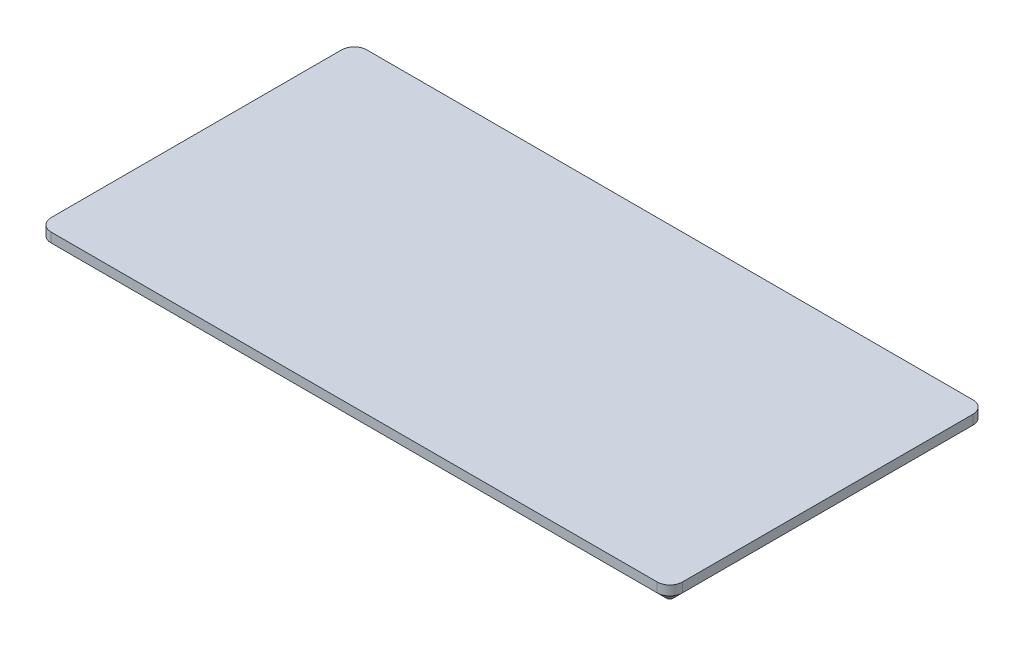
ISO-10303-21;
HEADER;
FILE_DESCRIPTION(('STEP AP214'),'2;1');
FILE_NAME('part.step','',(''),(''),'','','');
FILE_SCHEMA(('AUTOMOTIVE_DESIGN { 1 0 10303 214 1 1 1 1 }'));
ENDSEC;
DATA;
#1=APPLICATION_CONTEXT('core data for automotive mechanical design processes');
#2=APPLICATION_PROTOCOL_DEFINITION('international standard','automotive_design',2000,#1);
#3=PRODUCT_CONTEXT('',#1,'mechanical');
#4=PRODUCT('Part','Part','',(#3));
#5=PRODUCT_RELATED_PRODUCT_CATEGORY('part','',(#4));
#6=PRODUCT_DEFINITION_FORMATION('','',#4);
#7=PRODUCT_DEFINITION_CONTEXT('part definition',#1,'design');
#8=PRODUCT_DEFINITION('design','',#6,#7);
#9=PRODUCT_DEFINITION_SHAPE('','',#8);
#10=(LENGTH_UNIT() NAMED_UNIT(*) SI_UNIT(.MILLI.,.METRE.));
#11=(NAMED_UNIT(*) PLANE_ANGLE_UNIT() SI_UNIT($,.RADIAN.));
#12=(NAMED_UNIT(*) SI_UNIT($,.STERADIAN.) SOLID_ANGLE_UNIT());
#13=UNCERTAINTY_MEASURE_WITH_UNIT(LENGTH_MEASURE(1.E-05),#10,'distance_accuracy_value','');
#14=(GEOMETRIC_REPRESENTATION_CONTEXT(3) GLOBAL_UNCERTAINTY_ASSIGNED_CONTEXT((#13)) GLOBAL_UNIT_ASSIGNED_CONTEXT((#10,
#11,#12)) REPRESENTATION_CONTEXT('',''));
#15=CARTESIAN_POINT('',(0.,0.,0.));
#16=DIRECTION('',(0.,0.,1.));
#17=DIRECTION('',(1.,0.,0.));
#18=AXIS2_PLACEMENT_3D('',#15,#16,#17);
#19=CARTESIAN_POINT('',(500.,30.,-250.));
#20=DIRECTION('',(-1.,0.,0.));
#21=DIRECTION('',(0.,0.,1.));
#22=AXIS2_PLACEMENT_3D('',#19,#20,#21);
#23=PLANE('',#22);
#24=DIRECTION('',(0.,-1.,0.));
#25=VECTOR('',#24,1.);
#26=CARTESIAN_POINT('',(500.,30.,230.));
#27=LINE('',#26,#25);
#28=CARTESIAN_POINT('',(500.,30.,230.));
#29=VERTEX_POINT('',#28);
#30=CARTESIAN_POINT('',(500.,15.,230.));
#31=VERTEX_POINT('',#30);
#32=EDGE_CURVE('E147',#29,#31,#27,.T.);
#33=ORIENTED_EDGE('',*,*,#32,.T.);
#34=DIRECTION('',(0.,0.,-1.));
#35=VECTOR('',#34,1.);
#36=CARTESIAN_POINT('',(500.,15.,-250.));
#37=LINE('',#36,#35);
#38=CARTESIAN_POINT('',(500.,15.,-230.));
#39=VERTEX_POINT('',#38);
#40=EDGE_CURVE('E178',#31,#39,#37,.T.);
#41=ORIENTED_EDGE('',*,*,#40,.T.);
#42=DIRECTION('',(0.,-1.,0.));
#43=VECTOR('',#42,1.);
#44=CARTESIAN_POINT('',(500.,30.,-230.));
#45=LINE('',#44,#43);
#46=CARTESIAN_POINT('',(500.,30.,-230.));
#47=VERTEX_POINT('',#46);
#48=EDGE_CURVE('E150',#39,#47,#45,.F.);
#49=ORIENTED_EDGE('',*,*,#48,.T.);
#50=DIRECTION('',(0.,0.,-1.));
#51=VECTOR('',#50,1.);
#52=CARTESIAN_POINT('',(500.,30.,-250.));
#53=LINE('',#52,#51);
#54=EDGE_CURVE('E134',#29,#47,#53,.T.);
#55=ORIENTED_EDGE('',*,*,#54,.F.);
#56=EDGE_LOOP('',(#33,#41,#49,#55));
#57=FACE_BOUND('',#56,.T.);
#58=ADVANCED_FACE('F38',(#57),#23,.F.);
#59=CARTESIAN_POINT('',(-500.,30.,-250.));
#60=DIRECTION('',(0.,0.,1.));
#61=DIRECTION('',(1.,0.,0.));
#62=AXIS2_PLACEMENT_3D('',#59,#60,#61);
#63=PLANE('',#62);
#64=DIRECTION('',(0.,-1.,0.));
#65=VECTOR('',#64,1.);
#66=CARTESIAN_POINT('',(480.,30.,-250.));
#67=LINE('',#66,#65);
#68=CARTESIAN_POINT('',(480.,30.,-250.));
#69=VERTEX_POINT('',#68);
#70=CARTESIAN_POINT('',(480.,15.,-250.));
#71=VERTEX_POINT('',#70);
#72=EDGE_CURVE('E175',#69,#71,#67,.T.);
#73=ORIENTED_EDGE('',*,*,#72,.T.);
#74=DIRECTION('',(-1.,0.,0.));
#75=VECTOR('',#74,1.);
#76=CARTESIAN_POINT('',(-500.,15.,-250.));
#77=LINE('',#76,#75);
#78=CARTESIAN_POINT('',(-480.,15.,-250.));
#79=VERTEX_POINT('',#78);
#80=EDGE_CURVE('E200',#71,#79,#77,.T.);
#81=ORIENTED_EDGE('',*,*,#80,.T.);
#82=DIRECTION('',(0.,-1.,0.));
#83=VECTOR('',#82,1.);
#84=CARTESIAN_POINT('',(-480.,30.,-250.));
#85=LINE('',#84,#83);
#86=CARTESIAN_POINT('',(-480.,30.,-250.));
#87=VERTEX_POINT('',#86);
#88=EDGE_CURVE('E173',#79,#87,#85,.F.);
#89=ORIENTED_EDGE('',*,*,#88,.T.);
#90=DIRECTION('',(-1.,0.,0.));
#91=VECTOR('',#90,1.);
#92=CARTESIAN_POINT('',(-500.,30.,-250.));
#93=LINE('',#92,#91);
#94=EDGE_CURVE('E151',#69,#87,#93,.T.);
#95=ORIENTED_EDGE('',*,*,#94,.F.);
#96=EDGE_LOOP('',(#73,#81,#89,#95));
#97=FACE_BOUND('',#96,.T.);
#98=ADVANCED_FACE('F259',(#97),#63,.F.);
#99=CARTESIAN_POINT('',(-500.,30.,-250.));
#100=DIRECTION('',(1.,0.,0.));
#101=DIRECTION('',(0.,0.,-1.));
#102=AXIS2_PLACEMENT_3D('',#99,#100,#101);
#103=PLANE('',#102);
#104=DIRECTION('',(0.,-1.,0.));
#105=VECTOR('',#104,1.);
#106=CARTESIAN_POINT('',(-500.,30.,-230.));
#107=LINE('',#106,#105);
#108=CARTESIAN_POINT('',(-500.,30.,-230.));
#109=VERTEX_POINT('',#108);
#110=CARTESIAN_POINT('',(-500.,15.,-230.));
#111=VERTEX_POINT('',#110);
#112=EDGE_CURVE('E141',#109,#111,#107,.T.);
#113=ORIENTED_EDGE('',*,*,#112,.T.);
#114=DIRECTION('',(0.,0.,1.));
#115=VECTOR('',#114,1.);
#116=CARTESIAN_POINT('',(-500.,15.,-250.));
#117=LINE('',#116,#115);
#118=CARTESIAN_POINT('',(-500.,15.,230.));
#119=VERTEX_POINT('',#118);
#120=EDGE_CURVE('E11',#111,#119,#117,.T.);
#121=ORIENTED_EDGE('',*,*,#120,.T.);
#122=DIRECTION('',(0.,-1.,0.));
#123=VECTOR('',#122,1.);
#124=CARTESIAN_POINT('',(-500.,30.,230.));
#125=LINE('',#124,#123);
#126=CARTESIAN_POINT('',(-500.,30.,230.));
#127=VERTEX_POINT('',#126);
#128=EDGE_CURVE('E171',#119,#127,#125,.F.);
#129=ORIENTED_EDGE('',*,*,#128,.T.);
#130=DIRECTION('',(0.,0.,1.));
#131=VECTOR('',#130,1.);
#132=CARTESIAN_POINT('',(-500.,30.,-250.));
#133=LINE('',#132,#131);
#134=EDGE_CURVE('E261',#109,#127,#133,.T.);
#135=ORIENTED_EDGE('',*,*,#134,.F.);
#136=EDGE_LOOP('',(#113,#121,#129,#135));
#137=FACE_BOUND('',#136,.T.);
#138=ADVANCED_FACE('F273',(#137),#103,.F.);
#139=CARTESIAN_POINT('',(-500.,30.,250.));
#140=DIRECTION('',(0.,0.,-1.));
#141=DIRECTION('',(-1.,0.,0.));
#142=AXIS2_PLACEMENT_3D('',#139,#140,#141);
#143=PLANE('',#142);
#144=DIRECTION('',(0.,-1.,0.));
#145=VECTOR('',#144,1.);
#146=CARTESIAN_POINT('',(-480.,30.,250.));
#147=LINE('',#146,#145);
#148=CARTESIAN_POINT('',(-480.,30.,250.));
#149=VERTEX_POINT('',#148);
#150=CARTESIAN_POINT('',(-480.,15.,250.));
#151=VERTEX_POINT('',#150);
#152=EDGE_CURVE('E156',#149,#151,#147,.T.);
#153=ORIENTED_EDGE('',*,*,#152,.T.);
#154=DIRECTION('',(1.,0.,0.));
#155=VECTOR('',#154,1.);
#156=CARTESIAN_POINT('',(-500.,15.,250.));
#157=LINE('',#156,#155);
#158=CARTESIAN_POINT('',(480.,15.,250.));
#159=VERTEX_POINT('',#158);
#160=EDGE_CURVE('E202',#151,#159,#157,.T.);
#161=ORIENTED_EDGE('',*,*,#160,.T.);
#162=DIRECTION('',(0.,-1.,0.));
#163=VECTOR('',#162,1.);
#164=CARTESIAN_POINT('',(480.,30.,250.));
#165=LINE('',#164,#163);
#166=CARTESIAN_POINT('',(480.,30.,250.));
#167=VERTEX_POINT('',#166);
#168=EDGE_CURVE('E159',#159,#167,#165,.F.);
#169=ORIENTED_EDGE('',*,*,#168,.T.);
#170=DIRECTION('',(1.,0.,0.));
#171=VECTOR('',#170,1.);
#172=CARTESIAN_POINT('',(-500.,30.,250.));
#173=LINE('',#172,#171);
#174=EDGE_CURVE('E137',#149,#167,#173,.T.);
#175=ORIENTED_EDGE('',*,*,#174,.F.);
#176=EDGE_LOOP('',(#153,#161,#169,#175));
#177=FACE_BOUND('',#176,.T.);
#178=ADVANCED_FACE('F271',(#177),#143,.F.);
#179=CARTESIAN_POINT('',(0.,30.,0.));
#180=DIRECTION('',(0.,1.,0.));
#181=DIRECTION('',(0.,0.,1.));
#182=AXIS2_PLACEMENT_3D('',#179,#180,#181);
#183=PLANE('',#182);
#184=ORIENTED_EDGE('',*,*,#174,.T.);
#185=CARTESIAN_POINT('',(480.,30.,230.));
#186=DIRECTION('',(0.,1.,0.));
#187=DIRECTION('',(0.,0.,1.));
#188=AXIS2_PLACEMENT_3D('',#185,#186,#187);
#189=CIRCLE('',#188,20.);
#190=EDGE_CURVE('E131',#167,#29,#189,.T.);
#191=ORIENTED_EDGE('',*,*,#190,.T.);
#192=ORIENTED_EDGE('',*,*,#54,.T.);
#193=CARTESIAN_POINT('',(480.,30.,-230.));
#194=DIRECTION('',(0.,1.,0.));
#195=DIRECTION('',(0.,0.,1.));
#196=AXIS2_PLACEMENT_3D('',#193,#194,#195);
#197=CIRCLE('',#196,20.);
#198=EDGE_CURVE('E167',#47,#69,#197,.T.);
#199=ORIENTED_EDGE('',*,*,#198,.T.);
#200=ORIENTED_EDGE('',*,*,#94,.T.);
#201=CARTESIAN_POINT('',(-480.,30.,-230.));
#202=DIRECTION('',(0.,1.,0.));
#203=DIRECTION('',(0.,0.,1.));
#204=AXIS2_PLACEMENT_3D('',#201,#202,#203);
#205=CIRCLE('',#204,20.);
#206=EDGE_CURVE('E165',#87,#109,#205,.T.);
#207=ORIENTED_EDGE('',*,*,#206,.T.);
#208=ORIENTED_EDGE('',*,*,#134,.T.);
#209=CARTESIAN_POINT('',(-480.,30.,230.));
#210=DIRECTION('',(0.,1.,0.));
#211=DIRECTION('',(0.,0.,1.));
#212=AXIS2_PLACEMENT_3D('',#209,#210,#211);
#213=CIRCLE('',#212,20.);
#214=EDGE_CURVE('E142',#127,#149,#213,.T.);
#215=ORIENTED_EDGE('',*,*,#214,.T.);
#216=EDGE_LOOP('',(#184,#191,#192,#199,#200,#207,#208,#215));
#217=FACE_BOUND('',#216,.T.);
#218=ADVANCED_FACE('F133',(#217),#183,.T.);
#219=CARTESIAN_POINT('',(0.,0.,0.));
#220=DIRECTION('',(0.,1.,0.));
#221=DIRECTION('',(0.,0.,1.));
#222=AXIS2_PLACEMENT_3D('',#219,#220,#221);
#223=PLANE('',#222);
#224=CARTESIAN_POINT('',(480.,0.,-230.));
#225=DIRECTION('',(0.,1.,0.));
#226=DIRECTION('',(0.,0.,1.));
#227=AXIS2_PLACEMENT_3D('',#224,#225,#226);
#228=CIRCLE('',#227,5.);
#229=CARTESIAN_POINT('',(480.,0.,-235.));
#230=VERTEX_POINT('',#229);
#231=CARTESIAN_POINT('',(485.,0.,-230.));
#232=VERTEX_POINT('',#231);
#233=EDGE_CURVE('E192',#230,#232,#228,.F.);
#234=ORIENTED_EDGE('',*,*,#233,.T.);
#235=DIRECTION('',(0.,0.,1.));
#236=VECTOR('',#235,1.);
#237=CARTESIAN_POINT('',(485.,0.,0.));
#238=LINE('',#237,#236);
#239=CARTESIAN_POINT('',(485.,0.,230.));
#240=VERTEX_POINT('',#239);
#241=EDGE_CURVE('E194',#232,#240,#238,.T.);
#242=ORIENTED_EDGE('',*,*,#241,.T.);
#243=CARTESIAN_POINT('',(480.,0.,230.));
#244=DIRECTION('',(0.,1.,0.));
#245=DIRECTION('',(0.,0.,1.));
#246=AXIS2_PLACEMENT_3D('',#243,#244,#245);
#247=CIRCLE('',#246,4.99999999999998);
#248=CARTESIAN_POINT('',(480.,0.,235.));
#249=VERTEX_POINT('',#248);
#250=EDGE_CURVE('E190',#240,#249,#247,.F.);
#251=ORIENTED_EDGE('',*,*,#250,.T.);
#252=DIRECTION('',(-1.,0.,0.));
#253=VECTOR('',#252,1.);
#254=CARTESIAN_POINT('',(0.,0.,235.));
#255=LINE('',#254,#253);
#256=CARTESIAN_POINT('',(-480.,0.,235.));
#257=VERTEX_POINT('',#256);
#258=EDGE_CURVE('E186',#249,#257,#255,.T.);
#259=ORIENTED_EDGE('',*,*,#258,.T.);
#260=CARTESIAN_POINT('',(-480.,0.,230.));
#261=DIRECTION('',(0.,1.,0.));
#262=DIRECTION('',(0.,0.,1.));
#263=AXIS2_PLACEMENT_3D('',#260,#261,#262);
#264=CIRCLE('',#263,5.);
#265=CARTESIAN_POINT('',(-485.,0.,230.));
#266=VERTEX_POINT('',#265);
#267=EDGE_CURVE('E182',#257,#266,#264,.F.);
#268=ORIENTED_EDGE('',*,*,#267,.T.);
#269=DIRECTION('',(0.,0.,-1.));
#270=VECTOR('',#269,1.);
#271=CARTESIAN_POINT('',(-485.,0.,0.));
#272=LINE('',#271,#270);
#273=CARTESIAN_POINT('',(-485.,0.,-230.));
#274=VERTEX_POINT('',#273);
#275=EDGE_CURVE('E180',#266,#274,#272,.T.);
#276=ORIENTED_EDGE('',*,*,#275,.T.);
#277=CARTESIAN_POINT('',(-480.,0.,-230.));
#278=DIRECTION('',(0.,1.,0.));
#279=DIRECTION('',(0.,0.,1.));
#280=AXIS2_PLACEMENT_3D('',#277,#278,#279);
#281=CIRCLE('',#280,4.99999999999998);
#282=CARTESIAN_POINT('',(-480.,0.,-235.));
#283=VERTEX_POINT('',#282);
#284=EDGE_CURVE('E184',#274,#283,#281,.F.);
#285=ORIENTED_EDGE('',*,*,#284,.T.);
#286=DIRECTION('',(1.,0.,0.));
#287=VECTOR('',#286,1.);
#288=CARTESIAN_POINT('',(0.,0.,-235.));
#289=LINE('',#288,#287);
#290=EDGE_CURVE('E188',#283,#230,#289,.T.);
#291=ORIENTED_EDGE('',*,*,#290,.T.);
#292=EDGE_LOOP('',(#234,#242,#251,#259,#268,#276,#285,#291));
#293=FACE_BOUND('',#292,.T.);
#294=ADVANCED_FACE('F236',(#293),#223,.F.);
#295=CARTESIAN_POINT('',(480.,30.,230.));
#296=DIRECTION('',(0.,-1.,0.));
#297=DIRECTION('',(0.,0.,-1.));
#298=AXIS2_PLACEMENT_3D('',#295,#296,#297);
#299=CYLINDRICAL_SURFACE('',#298,20.);
#300=ORIENTED_EDGE('',*,*,#168,.F.);
#301=CARTESIAN_POINT('',(480.,15.,230.));
#302=DIRECTION('',(0.,1.,0.));
#303=DIRECTION('',(0.,0.,1.));
#304=AXIS2_PLACEMENT_3D('',#301,#302,#303);
#305=CIRCLE('',#304,20.);
#306=EDGE_CURVE('E155',#159,#31,#305,.T.);
#307=ORIENTED_EDGE('',*,*,#306,.T.);
#308=ORIENTED_EDGE('',*,*,#32,.F.);
#309=ORIENTED_EDGE('',*,*,#190,.F.);
#310=EDGE_LOOP('',(#300,#307,#308,#309));
#311=FACE_BOUND('',#310,.T.);
#312=ADVANCED_FACE('F153',(#311),#299,.T.);
#313=CARTESIAN_POINT('',(-480.,30.,230.));
#314=DIRECTION('',(0.,-1.,0.));
#315=DIRECTION('',(0.,0.,-1.));
#316=AXIS2_PLACEMENT_3D('',#313,#314,#315);
#317=CYLINDRICAL_SURFACE('',#316,20.);
#318=ORIENTED_EDGE('',*,*,#128,.F.);
#319=CARTESIAN_POINT('',(-480.,15.,230.));
#320=DIRECTION('',(0.,1.,0.));
#321=DIRECTION('',(0.,0.,1.));
#322=AXIS2_PLACEMENT_3D('',#319,#320,#321);
#323=CIRCLE('',#322,20.);
#324=EDGE_CURVE('E48',#119,#151,#323,.T.);
#325=ORIENTED_EDGE('',*,*,#324,.T.);
#326=ORIENTED_EDGE('',*,*,#152,.F.);
#327=ORIENTED_EDGE('',*,*,#214,.F.);
#328=EDGE_LOOP('',(#318,#325,#326,#327));
#329=FACE_BOUND('',#328,.T.);
#330=ADVANCED_FACE('F269',(#329),#317,.T.);
#331=CARTESIAN_POINT('',(480.,30.,-230.));
#332=DIRECTION('',(0.,-1.,0.));
#333=DIRECTION('',(0.,0.,-1.));
#334=AXIS2_PLACEMENT_3D('',#331,#332,#333);
#335=CYLINDRICAL_SURFACE('',#334,20.);
#336=ORIENTED_EDGE('',*,*,#48,.F.);
#337=CARTESIAN_POINT('',(480.,15.,-230.));
#338=DIRECTION('',(0.,1.,0.));
#339=DIRECTION('',(0.,0.,1.));
#340=AXIS2_PLACEMENT_3D('',#337,#338,#339);
#341=CIRCLE('',#340,20.);
#342=EDGE_CURVE('E197',#39,#71,#341,.T.);
#343=ORIENTED_EDGE('',*,*,#342,.T.);
#344=ORIENTED_EDGE('',*,*,#72,.F.);
#345=ORIENTED_EDGE('',*,*,#198,.F.);
#346=EDGE_LOOP('',(#336,#343,#344,#345));
#347=FACE_BOUND('',#346,.T.);
#348=ADVANCED_FACE('F253',(#347),#335,.T.);
#349=CARTESIAN_POINT('',(-480.,30.,-230.));
#350=DIRECTION('',(0.,-1.,0.));
#351=DIRECTION('',(0.,0.,-1.));
#352=AXIS2_PLACEMENT_3D('',#349,#350,#351);
#353=CYLINDRICAL_SURFACE('',#352,20.);
#354=ORIENTED_EDGE('',*,*,#88,.F.);
#355=CARTESIAN_POINT('',(-480.,15.,-230.));
#356=DIRECTION('',(0.,1.,0.));
#357=DIRECTION('',(0.,0.,1.));
#358=AXIS2_PLACEMENT_3D('',#355,#356,#357);
#359=CIRCLE('',#358,20.);
#360=EDGE_CURVE('E62',#79,#111,#359,.T.);
#361=ORIENTED_EDGE('',*,*,#360,.T.);
#362=ORIENTED_EDGE('',*,*,#112,.F.);
#363=ORIENTED_EDGE('',*,*,#206,.F.);
#364=EDGE_LOOP('',(#354,#361,#362,#363));
#365=FACE_BOUND('',#364,.T.);
#366=ADVANCED_FACE('F295',(#365),#353,.T.);
#367=CARTESIAN_POINT('',(-500.,15.,-250.));
#368=DIRECTION('',(0.707106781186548,0.707106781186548,0.));
#369=DIRECTION('',(0.,0.,1.));
#370=AXIS2_PLACEMENT_3D('',#367,#368,#369);
#371=PLANE('',#370);
#372=DIRECTION('',(-0.707106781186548,0.707106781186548,0.));
#373=VECTOR('',#372,1.);
#374=CARTESIAN_POINT('',(-485.,0.,-230.));
#375=LINE('',#374,#373);
#376=EDGE_CURVE('E221',#274,#111,#375,.T.);
#377=ORIENTED_EDGE('',*,*,#376,.F.);
#378=ORIENTED_EDGE('',*,*,#275,.F.);
#379=DIRECTION('',(0.707106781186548,-0.707106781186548,0.));
#380=VECTOR('',#379,1.);
#381=CARTESIAN_POINT('',(-500.,15.,230.));
#382=LINE('',#381,#380);
#383=EDGE_CURVE('E43',#119,#266,#382,.T.);
#384=ORIENTED_EDGE('',*,*,#383,.F.);
#385=ORIENTED_EDGE('',*,*,#120,.F.);
#386=EDGE_LOOP('',(#377,#378,#384,#385));
#387=FACE_BOUND('',#386,.T.);
#388=ADVANCED_FACE('F41',(#387),#371,.F.);
#389=CARTESIAN_POINT('',(-480.,0.,230.));
#390=DIRECTION('',(0.,1.,0.));
#391=DIRECTION('',(0.,0.,1.));
#392=AXIS2_PLACEMENT_3D('',#389,#390,#391);
#393=CONICAL_SURFACE('',#392,5.,0.785398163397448);
#394=ORIENTED_EDGE('',*,*,#383,.T.);
#395=ORIENTED_EDGE('',*,*,#267,.F.);
#396=DIRECTION('',(0.,-0.707106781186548,-0.707106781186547));
#397=VECTOR('',#396,1.);
#398=CARTESIAN_POINT('',(-480.,15.,250.));
#399=LINE('',#398,#397);
#400=EDGE_CURVE('E219',#151,#257,#399,.T.);
#401=ORIENTED_EDGE('',*,*,#400,.F.);
#402=ORIENTED_EDGE('',*,*,#324,.F.);
#403=EDGE_LOOP('',(#394,#395,#401,#402));
#404=FACE_BOUND('',#403,.T.);
#405=ADVANCED_FACE('F231',(#404),#393,.T.);
#406=CARTESIAN_POINT('',(-480.,0.,-230.));
#407=DIRECTION('',(0.,1.,0.));
#408=DIRECTION('',(0.,0.,1.));
#409=AXIS2_PLACEMENT_3D('',#406,#407,#408);
#410=CONICAL_SURFACE('',#409,4.99999999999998,0.785398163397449);
#411=ORIENTED_EDGE('',*,*,#376,.T.);
#412=ORIENTED_EDGE('',*,*,#360,.F.);
#413=DIRECTION('',(0.,0.707106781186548,-0.707106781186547));
#414=VECTOR('',#413,1.);
#415=CARTESIAN_POINT('',(-480.,0.,-235.));
#416=LINE('',#415,#414);
#417=EDGE_CURVE('E216',#283,#79,#416,.T.);
#418=ORIENTED_EDGE('',*,*,#417,.F.);
#419=ORIENTED_EDGE('',*,*,#284,.F.);
#420=EDGE_LOOP('',(#411,#412,#418,#419));
#421=FACE_BOUND('',#420,.T.);
#422=ADVANCED_FACE('F328',(#421),#410,.T.);
#423=CARTESIAN_POINT('',(-500.,15.,250.));
#424=DIRECTION('',(0.,0.707106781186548,-0.707106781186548));
#425=DIRECTION('',(1.,0.,0.));
#426=AXIS2_PLACEMENT_3D('',#423,#424,#425);
#427=PLANE('',#426);
#428=ORIENTED_EDGE('',*,*,#400,.T.);
#429=ORIENTED_EDGE('',*,*,#258,.F.);
#430=DIRECTION('',(0.,-0.707106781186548,-0.707106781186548));
#431=VECTOR('',#430,1.);
#432=CARTESIAN_POINT('',(480.,15.,250.));
#433=LINE('',#432,#431);
#434=EDGE_CURVE('E213',#159,#249,#433,.T.);
#435=ORIENTED_EDGE('',*,*,#434,.F.);
#436=ORIENTED_EDGE('',*,*,#160,.F.);
#437=EDGE_LOOP('',(#428,#429,#435,#436));
#438=FACE_BOUND('',#437,.T.);
#439=ADVANCED_FACE('F242',(#438),#427,.F.);
#440=CARTESIAN_POINT('',(-500.,15.,-250.));
#441=DIRECTION('',(0.,0.707106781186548,0.707106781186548));
#442=DIRECTION('',(-1.,0.,0.));
#443=AXIS2_PLACEMENT_3D('',#440,#441,#442);
#444=PLANE('',#443);
#445=ORIENTED_EDGE('',*,*,#417,.T.);
#446=ORIENTED_EDGE('',*,*,#80,.F.);
#447=DIRECTION('',(0.,0.707106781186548,-0.707106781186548));
#448=VECTOR('',#447,1.);
#449=CARTESIAN_POINT('',(480.,0.,-235.));
#450=LINE('',#449,#448);
#451=EDGE_CURVE('E210',#230,#71,#450,.T.);
#452=ORIENTED_EDGE('',*,*,#451,.F.);
#453=ORIENTED_EDGE('',*,*,#290,.F.);
#454=EDGE_LOOP('',(#445,#446,#452,#453));
#455=FACE_BOUND('',#454,.T.);
#456=ADVANCED_FACE('F316',(#455),#444,.F.);
#457=CARTESIAN_POINT('',(480.,0.,230.));
#458=DIRECTION('',(0.,1.,0.));
#459=DIRECTION('',(0.,0.,1.));
#460=AXIS2_PLACEMENT_3D('',#457,#458,#459);
#461=CONICAL_SURFACE('',#460,4.99999999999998,0.785398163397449);
#462=ORIENTED_EDGE('',*,*,#434,.T.);
#463=ORIENTED_EDGE('',*,*,#250,.F.);
#464=DIRECTION('',(-0.707106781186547,-0.707106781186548,0.));
#465=VECTOR('',#464,1.);
#466=CARTESIAN_POINT('',(500.,15.,230.));
#467=LINE('',#466,#465);
#468=EDGE_CURVE('E208',#31,#240,#467,.T.);
#469=ORIENTED_EDGE('',*,*,#468,.F.);
#470=ORIENTED_EDGE('',*,*,#306,.F.);
#471=EDGE_LOOP('',(#462,#463,#469,#470));
#472=FACE_BOUND('',#471,.T.);
#473=ADVANCED_FACE('F245',(#472),#461,.T.);
#474=CARTESIAN_POINT('',(480.,0.,-230.));
#475=DIRECTION('',(0.,1.,0.));
#476=DIRECTION('',(0.,0.,1.));
#477=AXIS2_PLACEMENT_3D('',#474,#475,#476);
#478=CONICAL_SURFACE('',#477,5.,0.785398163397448);
#479=ORIENTED_EDGE('',*,*,#451,.T.);
#480=ORIENTED_EDGE('',*,*,#342,.F.);
#481=DIRECTION('',(0.707106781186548,0.707106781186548,0.));
#482=VECTOR('',#481,1.);
#483=CARTESIAN_POINT('',(485.,0.,-230.));
#484=LINE('',#483,#482);
#485=EDGE_CURVE('E206',#232,#39,#484,.T.);
#486=ORIENTED_EDGE('',*,*,#485,.F.);
#487=ORIENTED_EDGE('',*,*,#233,.F.);
#488=EDGE_LOOP('',(#479,#480,#486,#487));
#489=FACE_BOUND('',#488,.T.);
#490=ADVANCED_FACE('F304',(#489),#478,.T.);
#491=CARTESIAN_POINT('',(500.,15.,-250.));
#492=DIRECTION('',(-0.707106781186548,0.707106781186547,0.));
#493=DIRECTION('',(0.,0.,-1.));
#494=AXIS2_PLACEMENT_3D('',#491,#492,#493);
#495=PLANE('',#494);
#496=ORIENTED_EDGE('',*,*,#468,.T.);
#497=ORIENTED_EDGE('',*,*,#241,.F.);
#498=ORIENTED_EDGE('',*,*,#485,.T.);
#499=ORIENTED_EDGE('',*,*,#40,.F.);
#500=EDGE_LOOP('',(#496,#497,#498,#499));
#501=FACE_BOUND('',#500,.T.);
#502=ADVANCED_FACE('F249',(#501),#495,.F.);
#503=CLOSED_SHELL('',(#58,#98,#138,#178,#218,#294,#312,#330,#348,#366,#388,#405,#422,#439,#456,
#473,#490,#502));
#504=MANIFOLD_SOLID_BREP('B2',#503);
#505=ADVANCED_BREP_SHAPE_REPRESENTATION('',(#18,#504),#14);
#506=SHAPE_DEFINITION_REPRESENTATION(#9,#505);
ENDSEC;
END-ISO-10303-21;
